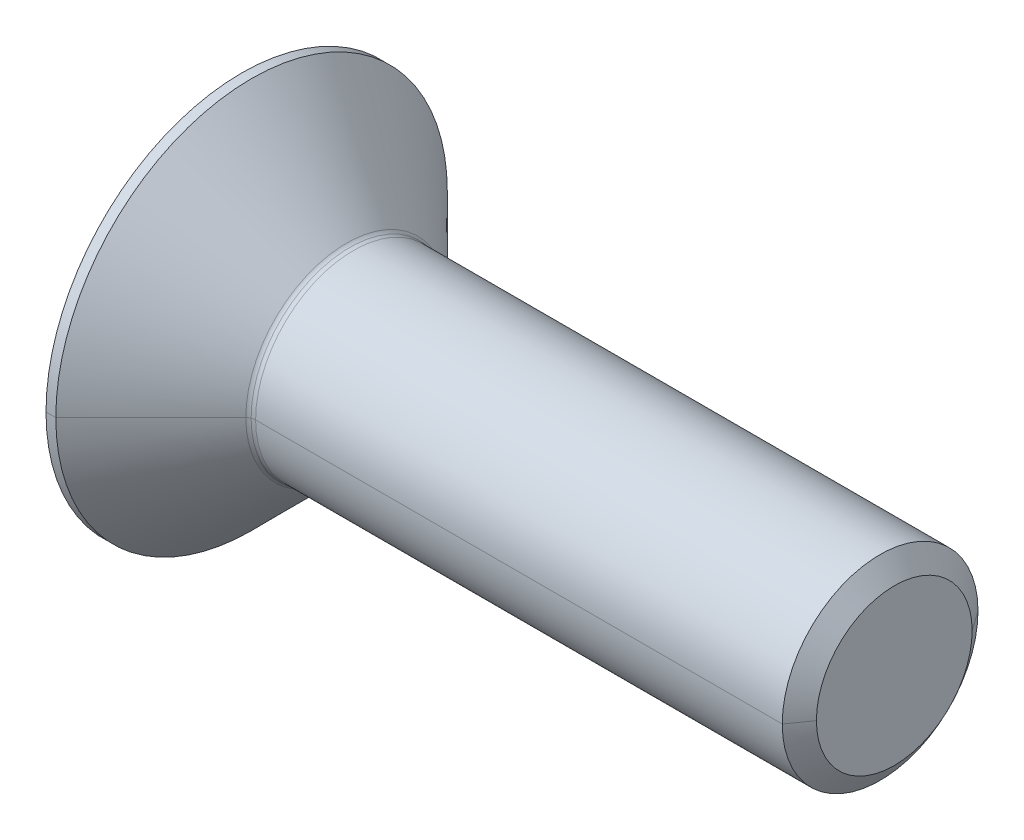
ISO-10303-21;
HEADER;
FILE_DESCRIPTION(('STEP AP214'),'2;1');
FILE_NAME('part.step','',(''),(''),'','','');
FILE_SCHEMA(('AUTOMOTIVE_DESIGN { 1 0 10303 214 1 1 1 1 }'));
ENDSEC;
DATA;
#1=APPLICATION_CONTEXT('core data for automotive mechanical design processes');
#2=APPLICATION_PROTOCOL_DEFINITION('international standard','automotive_design',2000,#1);
#3=PRODUCT_CONTEXT('',#1,'mechanical');
#4=PRODUCT('Part','Part','',(#3));
#5=PRODUCT_RELATED_PRODUCT_CATEGORY('part','',(#4));
#6=PRODUCT_DEFINITION_FORMATION('','',#4);
#7=PRODUCT_DEFINITION_CONTEXT('part definition',#1,'design');
#8=PRODUCT_DEFINITION('design','',#6,#7);
#9=PRODUCT_DEFINITION_SHAPE('','',#8);
#10=(LENGTH_UNIT() NAMED_UNIT(*) SI_UNIT(.MILLI.,.METRE.));
#11=(NAMED_UNIT(*) PLANE_ANGLE_UNIT() SI_UNIT($,.RADIAN.));
#12=(NAMED_UNIT(*) SI_UNIT($,.STERADIAN.) SOLID_ANGLE_UNIT());
#13=UNCERTAINTY_MEASURE_WITH_UNIT(LENGTH_MEASURE(1.E-05),#10,'distance_accuracy_value','');
#14=(GEOMETRIC_REPRESENTATION_CONTEXT(3) GLOBAL_UNCERTAINTY_ASSIGNED_CONTEXT((#13)) GLOBAL_UNIT_ASSIGNED_CONTEXT((#10,
#11,#12)) REPRESENTATION_CONTEXT('',''));
#15=CARTESIAN_POINT('',(0.,0.,0.));
#16=DIRECTION('',(0.,0.,1.));
#17=DIRECTION('',(1.,0.,0.));
#18=AXIS2_PLACEMENT_3D('',#15,#16,#17);
#19=CARTESIAN_POINT('',(0.,-1.151208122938,-2.00201228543));
#20=DIRECTION('',(0.,-0.865151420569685,-0.501510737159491));
#21=DIRECTION('',(0.,0.501510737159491,-0.865151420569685));
#22=AXIS2_PLACEMENT_3D('',#19,#20,#21);
#23=PLANE('',#22);
#24=DIRECTION('',(1.,0.,0.));
#25=VECTOR('',#24,1.);
#26=CARTESIAN_POINT('',(0.1154700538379,-2.30939755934,-0.004030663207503));
#27=LINE('',#26,#25);
#28=CARTESIAN_POINT('',(0.1154700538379,-2.30939755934,-0.004030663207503));
#29=VERTEX_POINT('',#28);
#30=CARTESIAN_POINT('',(2.5,-2.30939755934,-0.004030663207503));
#31=VERTEX_POINT('',#30);
#32=EDGE_CURVE('E404',#29,#31,#27,.T.);
#33=ORIENTED_EDGE('',*,*,#32,.T.);
#34=DIRECTION('',(0.,-0.501510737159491,0.865151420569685));
#35=VECTOR('',#34,1.);
#36=CARTESIAN_POINT('',(2.5,-1.151208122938,-2.00201228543));
#37=LINE('',#36,#35);
#38=CARTESIAN_POINT('',(2.5,-1.151208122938,-2.00201228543));
#39=VERTEX_POINT('',#38);
#40=EDGE_CURVE('E329',#39,#31,#37,.T.);
#41=ORIENTED_EDGE('',*,*,#40,.F.);
#42=DIRECTION('',(-1.,0.,0.));
#43=VECTOR('',#42,1.);
#44=CARTESIAN_POINT('',(2.5,-1.151208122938,-2.00201228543));
#45=LINE('',#44,#43);
#46=CARTESIAN_POINT('',(0.1154700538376,-1.151208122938,-2.00201228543));
#47=VERTEX_POINT('',#46);
#48=EDGE_CURVE('E301',#39,#47,#45,.T.);
#49=ORIENTED_EDGE('',*,*,#48,.T.);
#50=CARTESIAN_POINT('',(0.115470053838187,-2.30939755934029,-0.00403066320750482));
#51=CARTESIAN_POINT('',(0.141208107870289,-2.28357206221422,-0.0485769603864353));
#52=CARTESIAN_POINT('',(0.165950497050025,-2.25746920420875,-0.0935675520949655));
#53=CARTESIAN_POINT('',(0.212019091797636,-2.20576261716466,-0.182684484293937));
#54=CARTESIAN_POINT('',(0.233442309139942,-2.18018063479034,-0.226773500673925));
#55=CARTESIAN_POINT('',(0.27288784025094,-2.12939109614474,-0.314357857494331));
#56=CARTESIAN_POINT('',(0.291001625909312,-2.1042008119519,-0.357821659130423));
#57=CARTESIAN_POINT('',(0.323824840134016,-2.05402986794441,-0.444444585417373));
#58=CARTESIAN_POINT('',(0.338612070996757,-2.02906148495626,-0.487581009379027));
#59=CARTESIAN_POINT('',(0.357871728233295,-1.99235012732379,-0.550925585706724));
#60=CARTESIAN_POINT('',(0.363585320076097,-1.98078711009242,-0.570866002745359));
#61=CARTESIAN_POINT('',(0.374243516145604,-1.95774224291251,-0.610581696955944));
#62=CARTESIAN_POINT('',(0.379198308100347,-1.94626174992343,-0.630355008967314));
#63=CARTESIAN_POINT('',(0.388336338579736,-1.9233713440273,-0.669782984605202));
#64=CARTESIAN_POINT('',(0.392528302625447,-1.91196229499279,-0.689436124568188));
#65=CARTESIAN_POINT('',(0.400143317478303,-1.8891961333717,-0.728667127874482));
#66=CARTESIAN_POINT('',(0.403573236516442,-1.8778395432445,-0.748243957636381));
#67=CARTESIAN_POINT('',(0.409665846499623,-1.85515676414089,-0.7873655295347));
#68=CARTESIAN_POINT('',(0.412333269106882,-1.84383083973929,-0.806909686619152));
#69=CARTESIAN_POINT('',(0.416903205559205,-1.82118353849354,-0.846007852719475));
#70=CARTESIAN_POINT('',(0.41880807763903,-1.80986225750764,-0.865561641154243));
#71=CARTESIAN_POINT('',(0.421855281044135,-1.78719448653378,-0.904719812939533));
#72=CARTESIAN_POINT('',(0.422997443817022,-1.77584799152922,-0.92432420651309));
#73=CARTESIAN_POINT('',(0.424522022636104,-1.75309579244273,-0.96362258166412));
#74=CARTESIAN_POINT('',(0.424901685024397,-1.74169002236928,-0.983316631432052));
#75=CARTESIAN_POINT('',(0.424903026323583,-1.71886724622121,-1.02268531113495));
#76=CARTESIAN_POINT('',(0.424525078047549,-1.70745024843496,-1.04235994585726));
#77=CARTESIAN_POINT('',(0.42300325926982,-1.68466420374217,-1.08161647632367));
#78=CARTESIAN_POINT('',(0.421862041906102,-1.67329512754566,-1.10119845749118));
#79=CARTESIAN_POINT('',(0.418816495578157,-1.65058726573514,-1.14031838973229));
#80=CARTESIAN_POINT('',(0.416912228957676,-1.63924847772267,-1.15985634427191));
#81=CARTESIAN_POINT('',(0.412343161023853,-1.61658011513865,-1.19893463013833));
#82=CARTESIAN_POINT('',(0.409675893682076,-1.60525069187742,-1.21847476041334));
#83=CARTESIAN_POINT('',(0.403583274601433,-1.58257672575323,-1.25760119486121));
#84=CARTESIAN_POINT('',(0.400153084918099,-1.57123256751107,-1.27718696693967));
#85=CARTESIAN_POINT('',(0.392537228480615,-1.54850150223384,-1.31644559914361));
#86=CARTESIAN_POINT('',(0.388344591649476,-1.53711523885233,-1.33611747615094));
#87=CARTESIAN_POINT('',(0.379204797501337,-1.51427089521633,-1.37558704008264));
#88=CARTESIAN_POINT('',(0.374248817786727,-1.50281371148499,-1.39538319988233));
#89=CARTESIAN_POINT('',(0.363588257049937,-1.47979138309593,-1.43513463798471));
#90=CARTESIAN_POINT('',(0.357873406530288,-1.46822725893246,-1.45508773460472));
#91=CARTESIAN_POINT('',(0.338617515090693,-1.43149889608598,-1.51842455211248));
#92=CARTESIAN_POINT('',(0.323835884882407,-1.40647769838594,-1.56151942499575));
#93=CARTESIAN_POINT('',(0.291020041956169,-1.35624773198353,-1.64809304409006));
#94=CARTESIAN_POINT('',(0.272907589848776,-1.33105271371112,-1.69154977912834));
#95=CARTESIAN_POINT('',(0.233461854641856,-1.28029324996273,-1.77915081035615));
#96=CARTESIAN_POINT('',(0.212036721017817,-1.25474769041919,-1.82326432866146));
#97=CARTESIAN_POINT('',(0.16596107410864,-1.2031074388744,-1.9124349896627));
#98=CARTESIAN_POINT('',(0.141213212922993,-1.17703438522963,-1.95745457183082));
#99=CARTESIAN_POINT('',(0.115470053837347,-1.15120812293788,-2.00201228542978));
#100=B_SPLINE_CURVE_WITH_KNOTS('',3,(#50,#51,#52,#53,#54,#55,#56,#57,#58,#59,#60,#61,#62,#63,
#64,#65,#66,#67,#68,#69,#70,#71,#72,#73,#74,#75,#76,#77,#78,#79,#80,#81,#82,#83,#84,#85,#86,#87,
#88,#89,#90,#91,#92,#93,#94,#95,#96,#97,#98,#99),.UNSPECIFIED.,.F.,.F.,(4,2,2,2,2,2,2,2,2,2,2,2,
2,2,2,2,2,2,2,2,2,2,2,2,4),(0.,0.172719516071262,0.338535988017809,0.498662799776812,
0.65452610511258,0.725761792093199,0.795936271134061,0.865249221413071,0.933909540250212,
1.00213404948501,1.07014590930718,1.13817279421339,1.20644490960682,1.27468343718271,
1.34268599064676,1.41068298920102,1.47890228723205,1.54756718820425,1.61689462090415,
1.68709355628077,1.75836371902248,1.91419494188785,2.07430973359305,2.24013655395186,
2.41289052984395),.UNSPECIFIED.);
#101=EDGE_CURVE('E11',#29,#47,#100,.T.);
#102=ORIENTED_EDGE('',*,*,#101,.F.);
#103=EDGE_LOOP('',(#33,#41,#49,#102));
#104=FACE_BOUND('',#103,.T.);
#105=ADVANCED_FACE('F16',(#104),#23,.F.);
#106=CARTESIAN_POINT('',(0.2133748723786,0.,8.071961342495E-13));
#107=DIRECTION('',(-1.,0.,3.64996555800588E-13));
#108=DIRECTION('',(3.64996555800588E-13,0.,1.));
#109=AXIS2_PLACEMENT_3D('',#106,#107,#108);
#110=CONICAL_SURFACE('',#109,2.211496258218,0.785398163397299);
#111=CARTESIAN_POINT('',(0.115470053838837,-1.15818943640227,1.99798162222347));
#112=CARTESIAN_POINT('',(0.141208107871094,-1.18385491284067,1.95334293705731));
#113=CARTESIAN_POINT('',(0.165950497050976,-1.20976647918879,1.90824190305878));
#114=CARTESIAN_POINT('',(0.212019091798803,-1.26109071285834,1.81890421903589));
#115=CARTESIAN_POINT('',(0.233442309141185,-1.2864819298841,1.7747050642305));
#116=CARTESIAN_POINT('',(0.272887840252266,-1.33693743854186,1.68692785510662));
#117=CARTESIAN_POINT('',(0.29100162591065,-1.36198305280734,1.64338052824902));
#118=CARTESIAN_POINT('',(0.323824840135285,-1.41191523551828,1.55661975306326));
#119=CARTESIAN_POINT('',(0.33861207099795,-1.43678828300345,1.51342828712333));
#120=CARTESIAN_POINT('',(0.357871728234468,-1.47329061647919,1.44996303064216));
#121=CARTESIAN_POINT('',(0.363585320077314,-1.4847780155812,1.42997895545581));
#122=CARTESIAN_POINT('',(0.374243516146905,-1.50765038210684,1.39016366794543));
#123=CARTESIAN_POINT('',(0.379198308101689,-1.5190343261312,1.37033461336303));
#124=CARTESIAN_POINT('',(0.388336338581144,-1.54173475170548,1.33079695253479));
#125=CARTESIAN_POINT('',(0.392528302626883,-1.55305034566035,1.31108985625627));
#126=CARTESIAN_POINT('',(0.400143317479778,-1.57564231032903,1.27175828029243));
#127=CARTESIAN_POINT('',(0.403573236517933,-1.58691804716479,1.25213476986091));
#128=CARTESIAN_POINT('',(0.409665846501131,-1.60945693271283,1.21293012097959));
#129=CARTESIAN_POINT('',(0.412333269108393,-1.62071970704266,1.19334950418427));
#130=CARTESIAN_POINT('',(0.416903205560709,-1.6432560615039,1.15418728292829));
#131=CARTESIAN_POINT('',(0.418808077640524,-1.65452949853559,1.13460587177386));
#132=CARTESIAN_POINT('',(0.421855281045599,-1.67710758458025,1.09539592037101));
#133=CARTESIAN_POINT('',(0.422997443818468,-1.68841223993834,1.07576737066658));
#134=CARTESIAN_POINT('',(0.424522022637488,-1.71106953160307,1.03641420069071));
#135=CARTESIAN_POINT('',(0.42490168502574,-1.72242219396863,1.01668948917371));
#136=CARTESIAN_POINT('',(0.42490302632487,-1.74510508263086,0.977240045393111));
#137=CARTESIAN_POINT('',(0.424525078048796,-1.75643531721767,0.957515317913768));
#138=CARTESIAN_POINT('',(0.423003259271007,-1.77903944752,0.918153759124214));
#139=CARTESIAN_POINT('',(0.421862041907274,-1.79031340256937,0.898516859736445));
#140=CARTESIAN_POINT('',(0.418816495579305,-1.81283832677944,0.859291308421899));
#141=CARTESIAN_POINT('',(0.416912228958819,-1.82408929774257,0.839702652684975));
#142=CARTESIAN_POINT('',(0.412343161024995,-1.84659790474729,0.800532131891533));
#143=CARTESIAN_POINT('',(0.409675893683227,-1.8578554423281,0.780950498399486));
#144=CARTESIAN_POINT('',(0.403583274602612,-1.88040294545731,0.741751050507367));
#145=CARTESIAN_POINT('',(0.4001530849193,-1.89169264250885,0.722133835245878));
#146=CARTESIAN_POINT('',(0.39253722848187,-1.91432608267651,0.682818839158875));
#147=CARTESIAN_POINT('',(0.388344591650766,-1.92566929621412,0.663122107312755));
#148=CARTESIAN_POINT('',(0.379204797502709,-1.94842876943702,0.623603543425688));
#149=CARTESIAN_POINT('',(0.374248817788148,-1.95984415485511,0.603783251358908));
#150=CARTESIAN_POINT('',(0.363588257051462,-1.9827587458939,0.563969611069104));
#151=CARTESIAN_POINT('',(0.357873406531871,-1.99425657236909,0.543978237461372));
#152=CARTESIAN_POINT('',(0.338617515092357,-2.03074368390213,0.480502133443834));
#153=CARTESIAN_POINT('',(0.323835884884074,-2.05555433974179,0.437285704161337));
#154=CARTESIAN_POINT('',(0.291020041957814,-2.10541430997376,0.350498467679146));
#155=CARTESIAN_POINT('',(0.272907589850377,-2.13045143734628,0.306950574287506));
#156=CARTESIAN_POINT('',(0.233461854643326,-2.18093642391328,0.219191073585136));
#157=CARTESIAN_POINT('',(0.212036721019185,-2.20636707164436,0.175011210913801));
#158=CARTESIAN_POINT('',(0.165961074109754,-2.25777100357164,0.0857041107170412));
#159=CARTESIAN_POINT('',(0.141213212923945,-2.2837225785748,0.0406143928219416));
#160=CARTESIAN_POINT('',(0.115470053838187,-2.30939755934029,-0.00403066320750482));
#161=B_SPLINE_CURVE_WITH_KNOTS('',3,(#111,#112,#113,#114,#115,#116,#117,#118,#119,#120,#121,
#122,#123,#124,#125,#126,#127,#128,#129,#130,#131,#132,#133,#134,#135,#136,#137,#138,#139,#140,
#141,#142,#143,#144,#145,#146,#147,#148,#149,#150,#151,#152,#153,#154,#155,#156,#157,#158,#159,
#160),.UNSPECIFIED.,.F.,.F.,(4,2,2,2,2,2,2,2,2,2,2,2,2,2,2,2,2,2,2,2,2,2,2,2,4),(0.,
0.172719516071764,0.338535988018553,0.498662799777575,0.654526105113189,0.725761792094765,
0.795936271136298,0.865249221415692,0.933909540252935,1.00213404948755,1.07014590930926,
1.13817279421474,1.20644490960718,1.27468343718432,1.3426859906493,1.41068298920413,
1.4789022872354,1.54756718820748,1.61689462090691,1.68709355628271,1.75836371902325,
1.91419494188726,2.07430973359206,2.24013655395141,2.41289052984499),.UNSPECIFIED.);
#162=CARTESIAN_POINT('',(0.1154700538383,-1.158189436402,1.997981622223));
#163=VERTEX_POINT('',#162);
#164=EDGE_CURVE('E379',#163,#29,#161,.T.);
#165=ORIENTED_EDGE('',*,*,#164,.T.);
#166=ORIENTED_EDGE('',*,*,#101,.T.);
#167=CARTESIAN_POINT('',(0.1154700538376,-1.151208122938,-2.00201228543));
#168=CARTESIAN_POINT('',(0.1461942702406,-1.089759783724,-2.001905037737));
#169=CARTESIAN_POINT('',(0.2026006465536,-0.9695372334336,-2.001695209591));
#170=CARTESIAN_POINT('',(0.2719089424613,-0.7985716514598,-2.001396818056));
#171=CARTESIAN_POINT('',(0.3277607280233,-0.6335959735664,-2.001108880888));
#172=CARTESIAN_POINT('',(0.3709207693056,-0.4727049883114,-2.000828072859));
#173=CARTESIAN_POINT('',(0.401850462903,-0.3138718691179,-2.000550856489));
#174=CARTESIAN_POINT('',(0.4204962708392,-0.1567494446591,-2.000276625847));
#175=CARTESIAN_POINT('',(0.4247770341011,-0.05216793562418,-2.000094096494));
#176=CARTESIAN_POINT('',(0.4248680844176,0.,-2.000003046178));
#177=(BOUNDED_CURVE() B_SPLINE_CURVE(3,(#167,#168,#169,#170,#171,#172,#173,#174,#175,#176),
.UNSPECIFIED.,.F.,.F.) B_SPLINE_CURVE_WITH_KNOTS((4,1,1,1,1,1,1,4),(0.,0.1428571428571,
0.2857142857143,0.4285714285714,0.5714285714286,0.7142857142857,0.8571428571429,1.),
.UNSPECIFIED.) CURVE() GEOMETRIC_REPRESENTATION_ITEM() RATIONAL_B_SPLINE_CURVE((1.,1.,1.,1.,1.,
1.,1.,1.,1.,1.)) REPRESENTATION_ITEM(''));
#178=CARTESIAN_POINT('',(0.4248680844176,0.,-2.000003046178));
#179=VERTEX_POINT('',#178);
#180=EDGE_CURVE('E221',#47,#179,#177,.T.);
#181=ORIENTED_EDGE('',*,*,#180,.T.);
#182=DIRECTION('',(-0.707106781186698,0.,-0.707106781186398));
#183=VECTOR('',#182,1.);
#184=CARTESIAN_POINT('',(0.4248680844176,0.,-2.000003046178));
#185=LINE('',#184,#183);
#186=CARTESIAN_POINT('',(-5.90028026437E-13,0.,-2.424871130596));
#187=VERTEX_POINT('',#186);
#188=EDGE_CURVE('E291',#179,#187,#185,.T.);
#189=ORIENTED_EDGE('',*,*,#188,.T.);
#190=CARTESIAN_POINT('',(0.,0.,8.850779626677E-13));
#191=DIRECTION('',(1.,0.,-3.65E-13));
#192=DIRECTION('',(3.65E-13,0.,1.));
#193=AXIS2_PLACEMENT_3D('',#190,#191,#192);
#194=CIRCLE('',#193,2.424871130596);
#195=CARTESIAN_POINT('',(5.903610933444E-13,0.,2.424871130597));
#196=VERTEX_POINT('',#195);
#197=EDGE_CURVE('E222',#196,#187,#194,.T.);
#198=ORIENTED_EDGE('',*,*,#197,.F.);
#199=DIRECTION('',(-0.707106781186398,0.,0.707106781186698));
#200=VECTOR('',#199,1.);
#201=CARTESIAN_POINT('',(0.424868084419,0.,2.000003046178));
#202=LINE('',#201,#200);
#203=CARTESIAN_POINT('',(0.424868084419,0.,2.000003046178));
#204=VERTEX_POINT('',#203);
#205=EDGE_CURVE('E295',#204,#196,#202,.T.);
#206=ORIENTED_EDGE('',*,*,#205,.F.);
#207=CARTESIAN_POINT('',(0.424868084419,0.,2.000003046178));
#208=CARTESIAN_POINT('',(0.4249597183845,-0.05250234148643,1.999911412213));
#209=CARTESIAN_POINT('',(0.4209923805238,-0.157745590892,1.999727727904));
#210=CARTESIAN_POINT('',(0.4026574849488,-0.3158357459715,1.999451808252));
#211=CARTESIAN_POINT('',(0.3718845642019,-0.4756221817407,1.999172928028));
#212=CARTESIAN_POINT('',(0.3287264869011,-0.6374714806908,1.998890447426));
#213=CARTESIAN_POINT('',(0.2727299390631,-0.803409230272,1.998600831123));
#214=CARTESIAN_POINT('',(0.2031200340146,-0.9753855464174,1.998300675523));
#215=CARTESIAN_POINT('',(0.1463878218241,-1.096353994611,1.998089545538));
#216=CARTESIAN_POINT('',(0.1154700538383,-1.158189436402,1.997981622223));
#217=(BOUNDED_CURVE() B_SPLINE_CURVE(3,(#207,#208,#209,#210,#211,#212,#213,#214,#215,#216),
.UNSPECIFIED.,.F.,.F.) B_SPLINE_CURVE_WITH_KNOTS((4,1,1,1,1,1,1,4),(0.,0.1428571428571,
0.2857142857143,0.4285714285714,0.5714285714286,0.7142857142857,0.8571428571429,1.),
.UNSPECIFIED.) CURVE() GEOMETRIC_REPRESENTATION_ITEM() RATIONAL_B_SPLINE_CURVE((1.,1.,1.,1.,1.,
1.,1.,1.,1.,1.)) REPRESENTATION_ITEM(''));
#218=EDGE_CURVE('E26',#204,#163,#217,.T.);
#219=ORIENTED_EDGE('',*,*,#218,.T.);
#220=EDGE_LOOP('',(#165,#166,#181,#189,#198,#206,#219));
#221=FACE_BOUND('',#220,.T.);
#222=ADVANCED_FACE('F348',(#221),#110,.F.);
#223=CARTESIAN_POINT('',(0.,-1.158189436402,1.997981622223));
#224=DIRECTION('',(0.,-0.00174532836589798,0.999998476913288));
#225=DIRECTION('',(-1.,0.,0.));
#226=AXIS2_PLACEMENT_3D('',#223,#224,#225);
#227=PLANE('',#226);
#228=CARTESIAN_POINT('',(0.1154700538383,1.151208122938,2.00201228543));
#229=CARTESIAN_POINT('',(0.1461942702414,1.089759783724,2.001905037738));
#230=CARTESIAN_POINT('',(0.2026006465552,0.9695372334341,2.001695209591));
#231=CARTESIAN_POINT('',(0.2719089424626,0.7985716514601,2.001396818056));
#232=CARTESIAN_POINT('',(0.3277607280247,0.6335959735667,2.001108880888));
#233=CARTESIAN_POINT('',(0.370920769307,0.4727049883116,2.000828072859));
#234=CARTESIAN_POINT('',(0.4018504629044,0.3138718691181,2.000550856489));
#235=CARTESIAN_POINT('',(0.4204962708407,0.1567494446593,2.000276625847));
#236=CARTESIAN_POINT('',(0.4247770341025,0.05216793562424,2.000094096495));
#237=CARTESIAN_POINT('',(0.424868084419,0.,2.000003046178));
#238=(BOUNDED_CURVE() B_SPLINE_CURVE(3,(#228,#229,#230,#231,#232,#233,#234,#235,#236,#237),
.UNSPECIFIED.,.F.,.F.) B_SPLINE_CURVE_WITH_KNOTS((4,1,1,1,1,1,1,4),(0.,0.1428571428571,
0.2857142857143,0.4285714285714,0.5714285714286,0.7142857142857,0.8571428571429,1.),
.UNSPECIFIED.) CURVE() GEOMETRIC_REPRESENTATION_ITEM() RATIONAL_B_SPLINE_CURVE((1.,1.,1.,1.,1.,
1.,1.,1.,1.,1.)) REPRESENTATION_ITEM(''));
#239=CARTESIAN_POINT('',(0.1154700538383,1.151208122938,2.00201228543));
#240=VERTEX_POINT('',#239);
#241=EDGE_CURVE('E309',#240,#204,#238,.T.);
#242=ORIENTED_EDGE('',*,*,#241,.F.);
#243=DIRECTION('',(-1.,0.,0.));
#244=VECTOR('',#243,1.);
#245=CARTESIAN_POINT('',(2.5,1.151208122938,2.00201228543));
#246=LINE('',#245,#244);
#247=CARTESIAN_POINT('',(2.5,1.151208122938,2.00201228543));
#248=VERTEX_POINT('',#247);
#249=EDGE_CURVE('E319',#248,#240,#246,.T.);
#250=ORIENTED_EDGE('',*,*,#249,.F.);
#251=DIRECTION('',(0.,-0.999998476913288,-0.00174532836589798));
#252=VECTOR('',#251,1.);
#253=CARTESIAN_POINT('',(2.5,1.151208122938,2.00201228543));
#254=LINE('',#253,#252);
#255=CARTESIAN_POINT('',(2.5,-1.158189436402,1.997981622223));
#256=VERTEX_POINT('',#255);
#257=EDGE_CURVE('E337',#248,#256,#254,.T.);
#258=ORIENTED_EDGE('',*,*,#257,.T.);
#259=DIRECTION('',(1.,0.,0.));
#260=VECTOR('',#259,1.);
#261=CARTESIAN_POINT('',(0.1154700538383,-1.158189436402,1.997981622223));
#262=LINE('',#261,#260);
#263=EDGE_CURVE('E341',#163,#256,#262,.T.);
#264=ORIENTED_EDGE('',*,*,#263,.F.);
#265=ORIENTED_EDGE('',*,*,#218,.F.);
#266=EDGE_LOOP('',(#242,#250,#258,#264,#265));
#267=FACE_BOUND('',#266,.T.);
#268=ADVANCED_FACE('F358',(#267),#227,.F.);
#269=CARTESIAN_POINT('',(0.,-2.30939755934,-0.004030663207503));
#270=DIRECTION('',(0.,-0.866896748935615,0.498487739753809));
#271=DIRECTION('',(-1.,0.,0.));
#272=AXIS2_PLACEMENT_3D('',#269,#270,#271);
#273=PLANE('',#272);
#274=ORIENTED_EDGE('',*,*,#263,.T.);
#275=DIRECTION('',(0.,0.498487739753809,0.866896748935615));
#276=VECTOR('',#275,1.);
#277=CARTESIAN_POINT('',(2.5,-2.30939755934,-0.004030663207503));
#278=LINE('',#277,#276);
#279=EDGE_CURVE('E333',#31,#256,#278,.T.);
#280=ORIENTED_EDGE('',*,*,#279,.F.);
#281=ORIENTED_EDGE('',*,*,#32,.F.);
#282=ORIENTED_EDGE('',*,*,#164,.F.);
#283=EDGE_LOOP('',(#274,#280,#281,#282));
#284=FACE_BOUND('',#283,.T.);
#285=ADVANCED_FACE('F386',(#284),#273,.F.);
#286=CARTESIAN_POINT('',(2.5,0.,0.));
#287=DIRECTION('',(1.,0.,0.));
#288=DIRECTION('',(0.,1.,0.));
#289=AXIS2_PLACEMENT_3D('',#286,#287,#288);
#290=PLANE('',#289);
#291=CARTESIAN_POINT('',(2.5,0.,4.172510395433E-13));
#292=DIRECTION('',(1.,0.,-3.64905216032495E-13));
#293=DIRECTION('',(3.64905216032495E-13,0.,1.));
#294=AXIS2_PLACEMENT_3D('',#291,#292,#293);
#295=CIRCLE('',#294,1.98);
#296=CARTESIAN_POINT('',(2.500000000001,0.,1.98));
#297=VERTEX_POINT('',#296);
#298=CARTESIAN_POINT('',(2.499999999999,0.,-1.98));
#299=VERTEX_POINT('',#298);
#300=EDGE_CURVE('E310',#297,#299,#295,.T.);
#301=ORIENTED_EDGE('',*,*,#300,.T.);
#302=CARTESIAN_POINT('',(2.5,0.,4.172510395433E-13));
#303=DIRECTION('',(1.,0.,-3.64905216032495E-13));
#304=DIRECTION('',(-3.64905216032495E-13,0.,-1.));
#305=AXIS2_PLACEMENT_3D('',#302,#303,#304);
#306=CIRCLE('',#305,1.98);
#307=EDGE_CURVE('E314',#299,#297,#306,.T.);
#308=ORIENTED_EDGE('',*,*,#307,.T.);
#309=EDGE_LOOP('',(#301,#308));
#310=FACE_BOUND('',#309,.T.);
#311=DIRECTION('',(0.,-0.498487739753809,-0.866896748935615));
#312=VECTOR('',#311,1.);
#313=CARTESIAN_POINT('',(2.5,2.30939755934,0.004030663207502));
#314=LINE('',#313,#312);
#315=CARTESIAN_POINT('',(2.5,2.30939755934,0.004030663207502));
#316=VERTEX_POINT('',#315);
#317=CARTESIAN_POINT('',(2.5,1.158189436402,-1.997981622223));
#318=VERTEX_POINT('',#317);
#319=EDGE_CURVE('E302',#316,#318,#314,.T.);
#320=ORIENTED_EDGE('',*,*,#319,.T.);
#321=DIRECTION('',(0.,0.999998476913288,0.00174532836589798));
#322=VECTOR('',#321,1.);
#323=CARTESIAN_POINT('',(2.5,-1.151208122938,-2.00201228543));
#324=LINE('',#323,#322);
#325=EDGE_CURVE('E296',#39,#318,#324,.T.);
#326=ORIENTED_EDGE('',*,*,#325,.F.);
#327=ORIENTED_EDGE('',*,*,#40,.T.);
#328=ORIENTED_EDGE('',*,*,#279,.T.);
#329=ORIENTED_EDGE('',*,*,#257,.F.);
#330=DIRECTION('',(0.,0.501510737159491,-0.865151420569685));
#331=VECTOR('',#330,1.);
#332=CARTESIAN_POINT('',(2.5,1.151208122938,2.00201228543));
#333=LINE('',#332,#331);
#334=EDGE_CURVE('E316',#248,#316,#333,.T.);
#335=ORIENTED_EDGE('',*,*,#334,.T.);
#336=EDGE_LOOP('',(#320,#326,#327,#328,#329,#335));
#337=FACE_BOUND('',#336,.T.);
#338=ADVANCED_FACE('F394',(#310,#337),#290,.F.);
#339=CARTESIAN_POINT('',(3.060145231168,0.,2.127980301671E-13));
#340=DIRECTION('',(-1.,0.,3.65051236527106E-13));
#341=DIRECTION('',(3.65051236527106E-13,0.,1.));
#342=AXIS2_PLACEMENT_3D('',#339,#340,#341);
#343=CONICAL_SURFACE('',#342,1.0098,1.0471975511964);
#344=DIRECTION('',(-0.50000000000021,0.,-0.866025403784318));
#345=VECTOR('',#344,1.);
#346=CARTESIAN_POINT('',(3.643153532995,0.,0.));
#347=LINE('',#346,#345);
#348=CARTESIAN_POINT('',(3.643153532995,0.,0.));
#349=VERTEX_POINT('',#348);
#350=EDGE_CURVE('E315',#349,#299,#347,.T.);
#351=ORIENTED_EDGE('',*,*,#350,.F.);
#352=DIRECTION('',(-0.49999999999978,0.,0.866025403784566));
#353=VECTOR('',#352,1.);
#354=CARTESIAN_POINT('',(3.643153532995,0.,0.));
#355=LINE('',#354,#353);
#356=EDGE_CURVE('E320',#349,#297,#355,.T.);
#357=ORIENTED_EDGE('',*,*,#356,.T.);
#358=ORIENTED_EDGE('',*,*,#307,.F.);
#359=EDGE_LOOP('',(#351,#357,#358));
#360=FACE_BOUND('',#359,.T.);
#361=ADVANCED_FACE('F701',(#360),#343,.F.);
#362=CARTESIAN_POINT('',(3.060145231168,0.,2.127980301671E-13));
#363=DIRECTION('',(-1.,0.,3.65051236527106E-13));
#364=DIRECTION('',(3.65051236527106E-13,0.,1.));
#365=AXIS2_PLACEMENT_3D('',#362,#363,#364);
#366=CONICAL_SURFACE('',#365,1.0098,1.0471975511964);
#367=ORIENTED_EDGE('',*,*,#356,.F.);
#368=ORIENTED_EDGE('',*,*,#350,.T.);
#369=ORIENTED_EDGE('',*,*,#300,.F.);
#370=EDGE_LOOP('',(#367,#368,#369));
#371=FACE_BOUND('',#370,.T.);
#372=ADVANCED_FACE('F362',(#371),#366,.F.);
#373=CARTESIAN_POINT('',(0.,1.151208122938,2.00201228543));
#374=DIRECTION('',(0.,0.865151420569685,0.501510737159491));
#375=DIRECTION('',(1.,0.,0.));
#376=AXIS2_PLACEMENT_3D('',#373,#374,#375);
#377=PLANE('',#376);
#378=DIRECTION('',(-1.,0.,0.));
#379=VECTOR('',#378,1.);
#380=CARTESIAN_POINT('',(2.5,2.30939755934,0.004030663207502));
#381=LINE('',#380,#379);
#382=CARTESIAN_POINT('',(0.1154700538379,2.30939755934,0.004030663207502));
#383=VERTEX_POINT('',#382);
#384=EDGE_CURVE('E305',#316,#383,#381,.T.);
#385=ORIENTED_EDGE('',*,*,#384,.F.);
#386=ORIENTED_EDGE('',*,*,#334,.F.);
#387=ORIENTED_EDGE('',*,*,#249,.T.);
#388=CARTESIAN_POINT('',(0.11547005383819,2.30939755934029,0.00403066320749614));
#389=CARTESIAN_POINT('',(0.141208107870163,2.28357206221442,0.0485769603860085));
#390=CARTESIAN_POINT('',(0.16595049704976,2.25746920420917,0.093567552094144));
#391=CARTESIAN_POINT('',(0.212019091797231,2.20576261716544,0.18268448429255));
#392=CARTESIAN_POINT('',(0.233442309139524,2.18018063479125,0.226773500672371));
#393=CARTESIAN_POINT('',(0.272887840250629,2.12939109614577,0.314357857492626));
#394=CARTESIAN_POINT('',(0.291001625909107,2.10420081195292,0.35782165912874));
#395=CARTESIAN_POINT('',(0.323824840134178,2.05402986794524,0.444444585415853));
#396=CARTESIAN_POINT('',(0.338612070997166,2.0290614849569,0.487581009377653));
#397=CARTESIAN_POINT('',(0.357871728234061,1.99235012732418,0.550925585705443));
#398=CARTESIAN_POINT('',(0.363585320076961,1.98078711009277,0.570866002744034));
#399=CARTESIAN_POINT('',(0.37424351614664,1.9577422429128,0.610581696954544));
#400=CARTESIAN_POINT('',(0.379198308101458,1.94626174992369,0.630355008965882));
#401=CARTESIAN_POINT('',(0.388336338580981,1.92337134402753,0.669782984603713));
#402=CARTESIAN_POINT('',(0.392528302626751,1.91196229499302,0.689436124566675));
#403=CARTESIAN_POINT('',(0.400143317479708,1.88919613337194,0.728667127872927));
#404=CARTESIAN_POINT('',(0.403573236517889,1.87783954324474,0.74824395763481));
#405=CARTESIAN_POINT('',(0.409665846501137,1.85515676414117,0.787365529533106));
#406=CARTESIAN_POINT('',(0.412333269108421,1.84383083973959,0.806909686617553));
#407=CARTESIAN_POINT('',(0.416903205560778,1.82118353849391,0.846007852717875));
#408=CARTESIAN_POINT('',(0.41880807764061,1.80986225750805,0.865561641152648));
#409=CARTESIAN_POINT('',(0.421855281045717,1.78719448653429,0.904719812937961));
#410=CARTESIAN_POINT('',(0.422997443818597,1.77584799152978,0.924324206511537));
#411=CARTESIAN_POINT('',(0.424522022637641,1.75309579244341,0.963622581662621));
#412=CARTESIAN_POINT('',(0.424901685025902,1.74169002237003,0.983316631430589));
#413=CARTESIAN_POINT('',(0.424903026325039,1.71886724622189,1.0226853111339));
#414=CARTESIAN_POINT('',(0.424525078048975,1.70745024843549,1.04235994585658));
#415=CARTESIAN_POINT('',(0.423003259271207,1.68466420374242,1.08161647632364));
#416=CARTESIAN_POINT('',(0.421862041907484,1.67329512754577,1.10119845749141));
#417=CARTESIAN_POINT('',(0.418816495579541,1.65058726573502,1.14031838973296));
#418=CARTESIAN_POINT('',(0.41691222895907,1.63924847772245,1.15985634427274));
#419=CARTESIAN_POINT('',(0.412343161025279,1.61658011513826,1.19893463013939));
#420=CARTESIAN_POINT('',(0.409675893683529,1.60525069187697,1.21847476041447));
#421=CARTESIAN_POINT('',(0.403583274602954,1.5825767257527,1.25760119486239));
#422=CARTESIAN_POINT('',(0.400153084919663,1.57123256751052,1.27718696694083));
#423=CARTESIAN_POINT('',(0.39253722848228,1.54850150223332,1.31644559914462));
#424=CARTESIAN_POINT('',(0.388344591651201,1.53711523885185,1.33611747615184));
#425=CARTESIAN_POINT('',(0.379204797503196,1.514270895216,1.37558704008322));
#426=CARTESIAN_POINT('',(0.374248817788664,1.50281371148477,1.39538319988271));
#427=CARTESIAN_POINT('',(0.36358825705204,1.47979138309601,1.4351346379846));
#428=CARTESIAN_POINT('',(0.357873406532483,1.46822725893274,1.45508773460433));
#429=CARTESIAN_POINT('',(0.338617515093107,1.43149889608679,1.51842455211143));
#430=CARTESIAN_POINT('',(0.323835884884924,1.40647769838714,1.56151942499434));
#431=CARTESIAN_POINT('',(0.291020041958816,1.3562477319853,1.64809304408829));
#432=CARTESIAN_POINT('',(0.272907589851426,1.33105271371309,1.69154977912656));
#433=CARTESIAN_POINT('',(0.233461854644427,1.28029324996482,1.77915081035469));
#434=CARTESIAN_POINT('',(0.212036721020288,1.25474769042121,1.82326432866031));
#435=CARTESIAN_POINT('',(0.165961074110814,1.20310743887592,1.91243498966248));
#436=CARTESIAN_POINT('',(0.141213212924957,1.17703438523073,1.95745457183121));
#437=CARTESIAN_POINT('',(0.115470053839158,1.15120812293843,2.00201228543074));
#438=B_SPLINE_CURVE_WITH_KNOTS('',3,(#388,#389,#390,#391,#392,#393,#394,#395,#396,#397,#398,
#399,#400,#401,#402,#403,#404,#405,#406,#407,#408,#409,#410,#411,#412,#413,#414,#415,#416,#417,
#418,#419,#420,#421,#422,#423,#424,#425,#426,#427,#428,#429,#430,#431,#432,#433,#434,#435,#436,
#437),.UNSPECIFIED.,.F.,.F.,(4,2,2,2,2,2,2,2,2,2,2,2,2,2,2,2,2,2,2,2,2,2,2,2,4),(0.,
0.17271951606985,0.338535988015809,0.498662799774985,0.6545261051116,0.725761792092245,
0.795936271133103,0.86524922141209,0.933909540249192,1.00213404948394,1.07014590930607,
1.13817279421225,1.20644490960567,1.27468343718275,1.3426859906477,1.41068298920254,
1.47890228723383,1.54756718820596,1.61689462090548,1.68709355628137,1.75836371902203,
1.91419494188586,2.07430973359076,2.24013655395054,2.41289052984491),.UNSPECIFIED.);
#439=EDGE_CURVE('E294',#383,#240,#438,.T.);
#440=ORIENTED_EDGE('',*,*,#439,.F.);
#441=EDGE_LOOP('',(#385,#386,#387,#440));
#442=FACE_BOUND('',#441,.T.);
#443=ADVANCED_FACE('F359',(#442),#377,.F.);
#444=CARTESIAN_POINT('',(0.2133748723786,0.,8.071961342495E-13));
#445=DIRECTION('',(-1.,0.,3.64996555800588E-13));
#446=DIRECTION('',(3.64996555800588E-13,0.,1.));
#447=AXIS2_PLACEMENT_3D('',#444,#445,#446);
#448=CONICAL_SURFACE('',#447,2.211496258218,0.785398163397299);
#449=ORIENTED_EDGE('',*,*,#241,.T.);
#450=ORIENTED_EDGE('',*,*,#205,.T.);
#451=CARTESIAN_POINT('',(0.,0.,8.850779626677E-13));
#452=DIRECTION('',(1.,0.,-3.65E-13));
#453=DIRECTION('',(-3.65E-13,0.,-1.));
#454=AXIS2_PLACEMENT_3D('',#451,#452,#453);
#455=CIRCLE('',#454,2.424871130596);
#456=EDGE_CURVE('E218',#187,#196,#455,.T.);
#457=ORIENTED_EDGE('',*,*,#456,.F.);
#458=ORIENTED_EDGE('',*,*,#188,.F.);
#459=CARTESIAN_POINT('',(0.4248680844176,0.,-2.000003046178));
#460=CARTESIAN_POINT('',(0.424959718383,0.05250234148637,-1.999911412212));
#461=CARTESIAN_POINT('',(0.4209923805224,0.1577455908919,-1.999727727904));
#462=CARTESIAN_POINT('',(0.4026574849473,0.3158357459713,-1.999451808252));
#463=CARTESIAN_POINT('',(0.3718845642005,0.4756221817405,-1.999172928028));
#464=CARTESIAN_POINT('',(0.3287264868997,0.6374714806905,-1.998890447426));
#465=CARTESIAN_POINT('',(0.2727299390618,0.8034092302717,-1.998600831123));
#466=CARTESIAN_POINT('',(0.203120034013,0.975385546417,-1.998300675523));
#467=CARTESIAN_POINT('',(0.1463878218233,1.096353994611,-1.998089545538));
#468=CARTESIAN_POINT('',(0.1154700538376,1.158189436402,-1.997981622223));
#469=(BOUNDED_CURVE() B_SPLINE_CURVE(3,(#459,#460,#461,#462,#463,#464,#465,#466,#467,#468),
.UNSPECIFIED.,.F.,.F.) B_SPLINE_CURVE_WITH_KNOTS((4,1,1,1,1,1,1,4),(0.,0.1428571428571,
0.2857142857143,0.4285714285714,0.5714285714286,0.7142857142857,0.8571428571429,1.),
.UNSPECIFIED.) CURVE() GEOMETRIC_REPRESENTATION_ITEM() RATIONAL_B_SPLINE_CURVE((1.,1.,1.,1.,1.,
1.,1.,1.,1.,1.)) REPRESENTATION_ITEM(''));
#470=CARTESIAN_POINT('',(0.1154700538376,1.158189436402,-1.997981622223));
#471=VERTEX_POINT('',#470);
#472=EDGE_CURVE('E306',#179,#471,#469,.T.);
#473=ORIENTED_EDGE('',*,*,#472,.T.);
#474=CARTESIAN_POINT('',(0.115470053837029,1.15818943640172,-1.9979816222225));
#475=CARTESIAN_POINT('',(0.141208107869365,1.18385491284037,-1.95334293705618));
#476=CARTESIAN_POINT('',(0.165950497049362,1.20976647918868,-1.90824190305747));
#477=CARTESIAN_POINT('',(0.212019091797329,1.26109071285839,-1.81890421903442));
#478=CARTESIAN_POINT('',(0.233442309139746,1.28648192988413,-1.77470506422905));
#479=CARTESIAN_POINT('',(0.272887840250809,1.33693743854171,-1.68692785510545));
#480=CARTESIAN_POINT('',(0.291001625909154,1.36198305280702,-1.6433805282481));
#481=CARTESIAN_POINT('',(0.323824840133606,1.41191523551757,-1.55661975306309));
#482=CARTESIAN_POINT('',(0.338612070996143,1.43678828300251,-1.51342828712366));
#483=CARTESIAN_POINT('',(0.357871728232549,1.47329061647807,-1.44996303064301));
#484=CARTESIAN_POINT('',(0.3635853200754,1.48477801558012,-1.42997895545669));
#485=CARTESIAN_POINT('',(0.374243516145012,1.50765038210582,-1.39016366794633));
#486=CARTESIAN_POINT('',(0.379198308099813,1.51903432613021,-1.37033461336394));
#487=CARTESIAN_POINT('',(0.388336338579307,1.54173475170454,-1.33079695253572));
#488=CARTESIAN_POINT('',(0.392528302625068,1.55305034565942,-1.31108985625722));
#489=CARTESIAN_POINT('',(0.400143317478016,1.57564231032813,-1.2717582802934));
#490=CARTESIAN_POINT('',(0.403573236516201,1.5869180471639,-1.25213476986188));
#491=CARTESIAN_POINT('',(0.409665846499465,1.60945693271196,-1.21293012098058));
#492=CARTESIAN_POINT('',(0.412333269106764,1.62071970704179,-1.19334950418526));
#493=CARTESIAN_POINT('',(0.416903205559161,1.64325606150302,-1.1541872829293));
#494=CARTESIAN_POINT('',(0.418808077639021,1.6545294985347,-1.13460587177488));
#495=CARTESIAN_POINT('',(0.421855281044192,1.67710758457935,-1.09539592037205));
#496=CARTESIAN_POINT('',(0.422997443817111,1.68841223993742,-1.07576737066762));
#497=CARTESIAN_POINT('',(0.424522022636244,1.71106953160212,-1.03641420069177));
#498=CARTESIAN_POINT('',(0.424901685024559,1.72242219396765,-1.01668948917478));
#499=CARTESIAN_POINT('',(0.424903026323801,1.74510508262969,-0.977240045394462));
#500=CARTESIAN_POINT('',(0.424525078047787,1.75643531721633,-0.957515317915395));
#501=CARTESIAN_POINT('',(0.423003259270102,1.77903944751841,-0.918153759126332));
#502=CARTESIAN_POINT('',(0.42186204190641,1.79031340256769,-0.898516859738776));
#503=CARTESIAN_POINT('',(0.418816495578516,1.81283832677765,-0.859291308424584));
#504=CARTESIAN_POINT('',(0.416912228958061,1.82408929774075,-0.839702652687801));
#505=CARTESIAN_POINT('',(0.41234316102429,1.84659790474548,-0.800532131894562));
#506=CARTESIAN_POINT('',(0.40967589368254,1.8578554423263,-0.780950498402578));
#507=CARTESIAN_POINT('',(0.403583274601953,1.88040294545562,-0.741751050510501));
#508=CARTESIAN_POINT('',(0.400153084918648,1.89169264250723,-0.722133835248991));
#509=CARTESIAN_POINT('',(0.392537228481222,1.91432608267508,-0.682818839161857));
#510=CARTESIAN_POINT('',(0.388344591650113,1.9256692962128,-0.663122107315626));
#511=CARTESIAN_POINT('',(0.379204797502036,1.94842876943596,-0.623603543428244));
#512=CARTESIAN_POINT('',(0.374248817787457,1.95984415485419,-0.603783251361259));
#513=CARTESIAN_POINT('',(0.363588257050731,1.98275874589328,-0.56396961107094));
#514=CARTESIAN_POINT('',(0.357873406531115,1.99425657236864,-0.543978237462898));
#515=CARTESIAN_POINT('',(0.338617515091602,2.030743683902,-0.480502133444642));
#516=CARTESIAN_POINT('',(0.323835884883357,2.0555543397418,-0.437285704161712));
#517=CARTESIAN_POINT('',(0.291020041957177,2.10541430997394,-0.35049846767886));
#518=CARTESIAN_POINT('',(0.272907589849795,2.13045143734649,-0.306950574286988));
#519=CARTESIAN_POINT('',(0.233461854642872,2.18093642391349,-0.219191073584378));
#520=CARTESIAN_POINT('',(0.212036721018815,2.20636707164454,-0.175011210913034));
#521=CARTESIAN_POINT('',(0.165961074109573,2.25777100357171,-0.0857041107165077));
#522=CARTESIAN_POINT('',(0.141213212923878,2.28372257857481,-0.0406143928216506));
#523=CARTESIAN_POINT('',(0.11547005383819,2.30939755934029,0.00403066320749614));
#524=B_SPLINE_CURVE_WITH_KNOTS('',3,(#474,#475,#476,#477,#478,#479,#480,#481,#482,#483,#484,
#485,#486,#487,#488,#489,#490,#491,#492,#493,#494,#495,#496,#497,#498,#499,#500,#501,#502,#503,
#504,#505,#506,#507,#508,#509,#510,#511,#512,#513,#514,#515,#516,#517,#518,#519,#520,#521,#522,
#523),.UNSPECIFIED.,.F.,.F.,(4,2,2,2,2,2,2,2,2,2,2,2,2,2,2,2,2,2,2,2,2,2,2,2,4),(0.,
0.172719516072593,0.338535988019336,0.498662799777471,0.654526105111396,0.725761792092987,
0.795936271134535,0.865249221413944,0.933909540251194,1.0021340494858,1.0701459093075,
1.13817279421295,1.20644490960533,1.2746834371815,1.34268599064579,1.41068298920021,
1.47890228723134,1.54756718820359,1.61689462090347,1.68709355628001,1.75836371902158,
1.91419494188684,2.07430973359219,2.24013655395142,2.4128905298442),.UNSPECIFIED.);
#525=EDGE_CURVE('E596',#471,#383,#524,.T.);
#526=ORIENTED_EDGE('',*,*,#525,.T.);
#527=ORIENTED_EDGE('',*,*,#439,.T.);
#528=EDGE_LOOP('',(#449,#450,#457,#458,#473,#526,#527));
#529=FACE_BOUND('',#528,.T.);
#530=ADVANCED_FACE('F448',(#529),#448,.F.);
#531=CARTESIAN_POINT('',(0.,2.30939755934,0.004030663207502));
#532=DIRECTION('',(0.,0.866896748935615,-0.498487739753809));
#533=DIRECTION('',(-1.,0.,0.));
#534=AXIS2_PLACEMENT_3D('',#531,#532,#533);
#535=PLANE('',#534);
#536=DIRECTION('',(-1.,0.,0.));
#537=VECTOR('',#536,1.);
#538=CARTESIAN_POINT('',(2.5,1.158189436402,-1.997981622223));
#539=LINE('',#538,#537);
#540=EDGE_CURVE('E300',#318,#471,#539,.T.);
#541=ORIENTED_EDGE('',*,*,#540,.F.);
#542=ORIENTED_EDGE('',*,*,#319,.F.);
#543=ORIENTED_EDGE('',*,*,#384,.T.);
#544=ORIENTED_EDGE('',*,*,#525,.F.);
#545=EDGE_LOOP('',(#541,#542,#543,#544));
#546=FACE_BOUND('',#545,.T.);
#547=ADVANCED_FACE('F777',(#546),#535,.F.);
#548=CARTESIAN_POINT('',(0.,1.158189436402,-1.997981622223));
#549=DIRECTION('',(0.,0.00174532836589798,-0.999998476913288));
#550=DIRECTION('',(-1.,0.,0.));
#551=AXIS2_PLACEMENT_3D('',#548,#549,#550);
#552=PLANE('',#551);
#553=ORIENTED_EDGE('',*,*,#180,.F.);
#554=ORIENTED_EDGE('',*,*,#48,.F.);
#555=ORIENTED_EDGE('',*,*,#325,.T.);
#556=ORIENTED_EDGE('',*,*,#540,.T.);
#557=ORIENTED_EDGE('',*,*,#472,.F.);
#558=EDGE_LOOP('',(#553,#554,#555,#556,#557));
#559=FACE_BOUND('',#558,.T.);
#560=ADVANCED_FACE('F416',(#559),#552,.F.);
#561=CARTESIAN_POINT('',(0.,0.,-4.212435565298));
#562=DIRECTION('',(-1.,0.,0.));
#563=DIRECTION('',(0.,0.,1.));
#564=AXIS2_PLACEMENT_3D('',#561,#562,#563);
#565=PLANE('',#564);
#566=ORIENTED_EDGE('',*,*,#197,.T.);
#567=ORIENTED_EDGE('',*,*,#456,.T.);
#568=EDGE_LOOP('',(#566,#567));
#569=FACE_BOUND('',#568,.T.);
#570=CARTESIAN_POINT('',(0.,0.,0.));
#571=DIRECTION('',(-1.,0.,3.65E-13));
#572=DIRECTION('',(3.65E-13,0.,1.));
#573=AXIS2_PLACEMENT_3D('',#570,#571,#572);
#574=CIRCLE('',#573,6.);
#575=CARTESIAN_POINT('',(2.19E-12,0.,6.));
#576=VERTEX_POINT('',#575);
#577=CARTESIAN_POINT('',(-2.19E-12,0.,-6.));
#578=VERTEX_POINT('',#577);
#579=EDGE_CURVE('E265',#576,#578,#574,.T.);
#580=ORIENTED_EDGE('',*,*,#579,.T.);
#581=CARTESIAN_POINT('',(0.,0.,0.));
#582=DIRECTION('',(-1.,0.,3.65E-13));
#583=DIRECTION('',(-3.65E-13,0.,-1.));
#584=AXIS2_PLACEMENT_3D('',#581,#582,#583);
#585=CIRCLE('',#584,6.);
#586=EDGE_CURVE('E262',#578,#576,#585,.T.);
#587=ORIENTED_EDGE('',*,*,#586,.T.);
#588=EDGE_LOOP('',(#580,#587));
#589=FACE_BOUND('',#588,.T.);
#590=ADVANCED_FACE('F450',(#569,#589),#565,.T.);
#591=CARTESIAN_POINT('',(0.15,0.,0.));
#592=DIRECTION('',(-1.,0.,3.65001178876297E-13));
#593=DIRECTION('',(-3.65001178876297E-13,0.,-1.));
#594=AXIS2_PLACEMENT_3D('',#591,#592,#593);
#595=CYLINDRICAL_SURFACE('',#594,6.);
#596=DIRECTION('',(-1.,0.,-3.443171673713E-12));
#597=VECTOR('',#596,1.);
#598=CARTESIAN_POINT('',(0.2999999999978,0.,-5.999999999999));
#599=LINE('',#598,#597);
#600=CARTESIAN_POINT('',(0.2999999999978,0.,-5.999999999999));
#601=VERTEX_POINT('',#600);
#602=EDGE_CURVE('E278',#601,#578,#599,.T.);
#603=ORIENTED_EDGE('',*,*,#602,.F.);
#604=CARTESIAN_POINT('',(0.3,0.,2.19E-12));
#605=DIRECTION('',(1.,0.,-3.65005696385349E-13));
#606=DIRECTION('',(3.65005696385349E-13,0.,1.));
#607=AXIS2_PLACEMENT_3D('',#604,#605,#606);
#608=CIRCLE('',#607,6.);
#609=CARTESIAN_POINT('',(0.3000000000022,0.,6.000000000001));
#610=VERTEX_POINT('',#609);
#611=EDGE_CURVE('E269',#610,#601,#608,.T.);
#612=ORIENTED_EDGE('',*,*,#611,.F.);
#613=DIRECTION('',(-1.,0.,-3.425408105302E-12));
#614=VECTOR('',#613,1.);
#615=CARTESIAN_POINT('',(0.3000000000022,0.,6.000000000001));
#616=LINE('',#615,#614);
#617=EDGE_CURVE('E277',#610,#576,#616,.T.);
#618=ORIENTED_EDGE('',*,*,#617,.T.);
#619=ORIENTED_EDGE('',*,*,#586,.F.);
#620=EDGE_LOOP('',(#603,#612,#618,#619));
#621=FACE_BOUND('',#620,.T.);
#622=ADVANCED_FACE('F453',(#621),#595,.T.);
#623=CARTESIAN_POINT('',(0.15,0.,0.));
#624=DIRECTION('',(-1.,0.,3.65001178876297E-13));
#625=DIRECTION('',(-3.65001178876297E-13,0.,-1.));
#626=AXIS2_PLACEMENT_3D('',#623,#624,#625);
#627=CYLINDRICAL_SURFACE('',#626,6.);
#628=ORIENTED_EDGE('',*,*,#617,.F.);
#629=CARTESIAN_POINT('',(0.3,0.,2.19E-12));
#630=DIRECTION('',(1.,0.,-3.65005696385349E-13));
#631=DIRECTION('',(-3.65005696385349E-13,0.,-1.));
#632=AXIS2_PLACEMENT_3D('',#629,#630,#631);
#633=CIRCLE('',#632,6.);
#634=EDGE_CURVE('E273',#601,#610,#633,.T.);
#635=ORIENTED_EDGE('',*,*,#634,.F.);
#636=ORIENTED_EDGE('',*,*,#602,.T.);
#637=ORIENTED_EDGE('',*,*,#579,.F.);
#638=EDGE_LOOP('',(#628,#635,#636,#637));
#639=FACE_BOUND('',#638,.T.);
#640=ADVANCED_FACE('F458',(#639),#627,.T.);
#641=CARTESIAN_POINT('',(1.756066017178,0.,1.65853590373E-12));
#642=DIRECTION('',(-1.,0.,3.65016853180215E-13));
#643=DIRECTION('',(-3.65016853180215E-13,0.,-1.));
#644=AXIS2_PLACEMENT_3D('',#641,#642,#643);
#645=CONICAL_SURFACE('',#644,4.543933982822,0.785398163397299);
#646=DIRECTION('',(-0.707106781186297,0.,0.707106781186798));
#647=VECTOR('',#646,1.);
#648=CARTESIAN_POINT('',(3.212132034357,0.,3.087867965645));
#649=LINE('',#648,#647);
#650=CARTESIAN_POINT('',(3.212132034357,0.,3.087867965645));
#651=VERTEX_POINT('',#650);
#652=EDGE_CURVE('E261',#651,#610,#649,.T.);
#653=ORIENTED_EDGE('',*,*,#652,.F.);
#654=CARTESIAN_POINT('',(3.212132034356,0.,0.));
#655=DIRECTION('',(1.,0.,0.));
#656=DIRECTION('',(0.,0.,-1.));
#657=AXIS2_PLACEMENT_3D('',#654,#655,#656);
#658=CIRCLE('',#657,3.087867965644);
#659=CARTESIAN_POINT('',(3.212132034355,0.,-3.087867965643));
#660=VERTEX_POINT('',#659);
#661=EDGE_CURVE('E241',#660,#651,#658,.T.);
#662=ORIENTED_EDGE('',*,*,#661,.F.);
#663=DIRECTION('',(-0.707106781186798,0.,-0.707106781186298));
#664=VECTOR('',#663,1.);
#665=CARTESIAN_POINT('',(3.212132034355,0.,-3.087867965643));
#666=LINE('',#665,#664);
#667=EDGE_CURVE('E257',#660,#601,#666,.T.);
#668=ORIENTED_EDGE('',*,*,#667,.T.);
#669=ORIENTED_EDGE('',*,*,#634,.T.);
#670=EDGE_LOOP('',(#653,#662,#668,#669));
#671=FACE_BOUND('',#670,.T.);
#672=ADVANCED_FACE('F462',(#671),#645,.T.);
#673=CARTESIAN_POINT('',(1.756066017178,0.,1.65853590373E-12));
#674=DIRECTION('',(-1.,0.,3.65016853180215E-13));
#675=DIRECTION('',(-3.65016853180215E-13,0.,-1.));
#676=AXIS2_PLACEMENT_3D('',#673,#674,#675);
#677=CONICAL_SURFACE('',#676,4.543933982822,0.785398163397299);
#678=ORIENTED_EDGE('',*,*,#667,.F.);
#679=CARTESIAN_POINT('',(3.212132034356,0.,0.));
#680=DIRECTION('',(1.,0.,0.));
#681=DIRECTION('',(0.,0.,1.));
#682=AXIS2_PLACEMENT_3D('',#679,#680,#681);
#683=CIRCLE('',#682,3.087867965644);
#684=EDGE_CURVE('E253',#651,#660,#683,.T.);
#685=ORIENTED_EDGE('',*,*,#684,.F.);
#686=ORIENTED_EDGE('',*,*,#652,.T.);
#687=ORIENTED_EDGE('',*,*,#611,.T.);
#688=EDGE_LOOP('',(#678,#685,#686,#687));
#689=FACE_BOUND('',#688,.T.);
#690=ADVANCED_FACE('F467',(#689),#677,.T.);
#691=CARTESIAN_POINT('',(3.424264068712,0.,0.));
#692=DIRECTION('',(-1.,0.,0.));
#693=DIRECTION('',(0.,0.,1.));
#694=AXIS2_PLACEMENT_3D('',#691,#692,#693);
#695=TOROIDAL_SURFACE('',#694,3.3,0.3);
#696=CARTESIAN_POINT('',(3.424264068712,0.,-3.3));
#697=DIRECTION('',(0.,1.,0.));
#698=DIRECTION('',(-0.707106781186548,0.,0.707106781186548));
#699=AXIS2_PLACEMENT_3D('',#696,#697,#698);
#700=CIRCLE('',#699,0.3);
#701=CARTESIAN_POINT('',(3.309459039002,0.,-3.022836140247));
#702=VERTEX_POINT('',#701);
#703=EDGE_CURVE('E212',#660,#702,#700,.T.);
#704=ORIENTED_EDGE('',*,*,#703,.T.);
#705=CARTESIAN_POINT('',(3.309459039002,0.,0.));
#706=DIRECTION('',(-1.,0.,0.));
#707=DIRECTION('',(0.,0.,-1.));
#708=AXIS2_PLACEMENT_3D('',#705,#706,#707);
#709=CIRCLE('',#708,3.022836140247);
#710=CARTESIAN_POINT('',(3.309459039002,0.,3.022836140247));
#711=VERTEX_POINT('',#710);
#712=EDGE_CURVE('E207',#702,#711,#709,.T.);
#713=ORIENTED_EDGE('',*,*,#712,.T.);
#714=CARTESIAN_POINT('',(3.424264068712,0.,3.3));
#715=DIRECTION('',(0.,-1.,0.));
#716=DIRECTION('',(-0.707106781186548,0.,-0.707106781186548));
#717=AXIS2_PLACEMENT_3D('',#714,#715,#716);
#718=CIRCLE('',#717,0.3);
#719=EDGE_CURVE('E209',#651,#711,#718,.T.);
#720=ORIENTED_EDGE('',*,*,#719,.F.);
#721=ORIENTED_EDGE('',*,*,#684,.T.);
#722=EDGE_LOOP('',(#704,#713,#720,#721));
#723=FACE_BOUND('',#722,.T.);
#724=ADVANCED_FACE('F470',(#723),#695,.F.);
#725=CARTESIAN_POINT('',(3.424264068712,0.,0.));
#726=DIRECTION('',(-1.,0.,0.));
#727=DIRECTION('',(0.,0.,1.));
#728=AXIS2_PLACEMENT_3D('',#725,#726,#727);
#729=TOROIDAL_SURFACE('',#728,3.3,0.3);
#730=ORIENTED_EDGE('',*,*,#719,.T.);
#731=CARTESIAN_POINT('',(3.309459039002,0.,0.));
#732=DIRECTION('',(-1.,0.,0.));
#733=DIRECTION('',(0.,0.,1.));
#734=AXIS2_PLACEMENT_3D('',#731,#732,#733);
#735=CIRCLE('',#734,3.022836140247);
#736=EDGE_CURVE('E213',#711,#702,#735,.T.);
#737=ORIENTED_EDGE('',*,*,#736,.T.);
#738=ORIENTED_EDGE('',*,*,#703,.F.);
#739=ORIENTED_EDGE('',*,*,#661,.T.);
#740=EDGE_LOOP('',(#730,#737,#738,#739));
#741=FACE_BOUND('',#740,.T.);
#742=ADVANCED_FACE('F475',(#741),#729,.F.);
#743=CARTESIAN_POINT('',(3.424264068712,0.,0.));
#744=DIRECTION('',(-1.,0.,0.));
#745=DIRECTION('',(0.,0.,1.));
#746=AXIS2_PLACEMENT_3D('',#743,#744,#745);
#747=TOROIDAL_SURFACE('',#746,3.3,0.3);
#748=CARTESIAN_POINT('',(3.424264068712,0.,-3.3));
#749=DIRECTION('',(0.,1.,0.));
#750=DIRECTION('',(-0.382683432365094,0.,0.923879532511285));
#751=AXIS2_PLACEMENT_3D('',#748,#749,#750);
#752=CIRCLE('',#751,0.3);
#753=CARTESIAN_POINT('',(3.424264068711,0.,-2.999999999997));
#754=VERTEX_POINT('',#753);
#755=EDGE_CURVE('E230',#702,#754,#752,.T.);
#756=ORIENTED_EDGE('',*,*,#755,.F.);
#757=ORIENTED_EDGE('',*,*,#736,.F.);
#758=CARTESIAN_POINT('',(3.424264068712,0.,3.3));
#759=DIRECTION('',(0.,-1.,0.));
#760=DIRECTION('',(-0.382683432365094,0.,-0.923879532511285));
#761=AXIS2_PLACEMENT_3D('',#758,#759,#760);
#762=CIRCLE('',#761,0.3);
#763=CARTESIAN_POINT('',(3.424264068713,0.,3.000000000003));
#764=VERTEX_POINT('',#763);
#765=EDGE_CURVE('E204',#711,#764,#762,.T.);
#766=ORIENTED_EDGE('',*,*,#765,.T.);
#767=CARTESIAN_POINT('',(3.424264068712,0.,2.945901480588E-12));
#768=DIRECTION('',(-1.,0.,3.65014731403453E-13));
#769=DIRECTION('',(3.65014731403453E-13,0.,1.));
#770=AXIS2_PLACEMENT_3D('',#767,#768,#769);
#771=CIRCLE('',#770,3.);
#772=EDGE_CURVE('E228',#764,#754,#771,.T.);
#773=ORIENTED_EDGE('',*,*,#772,.T.);
#774=EDGE_LOOP('',(#756,#757,#766,#773));
#775=FACE_BOUND('',#774,.T.);
#776=ADVANCED_FACE('F478',(#775),#747,.F.);
#777=CARTESIAN_POINT('',(11.49522702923,0.,0.));
#778=DIRECTION('',(-1.,0.,3.64870171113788E-13));
#779=DIRECTION('',(-3.64870171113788E-13,0.,-1.));
#780=AXIS2_PLACEMENT_3D('',#777,#778,#779);
#781=CYLINDRICAL_SURFACE('',#780,3.);
#782=DIRECTION('',(-1.,0.,1.584114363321E-13));
#783=VECTOR('',#782,1.);
#784=CARTESIAN_POINT('',(19.56618998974,0.,2.999999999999));
#785=LINE('',#784,#783);
#786=CARTESIAN_POINT('',(19.56618998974,0.,2.999999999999));
#787=VERTEX_POINT('',#786);
#788=EDGE_CURVE('E224',#787,#764,#785,.T.);
#789=ORIENTED_EDGE('',*,*,#788,.F.);
#790=CARTESIAN_POINT('',(19.56618998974,0.,7.742819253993E-13));
#791=DIRECTION('',(1.,0.,-3.64291929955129E-13));
#792=DIRECTION('',(-3.64291929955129E-13,0.,-1.));
#793=AXIS2_PLACEMENT_3D('',#790,#791,#792);
#794=CIRCLE('',#793,3.);
#795=CARTESIAN_POINT('',(19.56618998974,0.,-3.000000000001));
#796=VERTEX_POINT('',#795);
#797=EDGE_CURVE('E182',#796,#787,#794,.T.);
#798=ORIENTED_EDGE('',*,*,#797,.F.);
#799=DIRECTION('',(-1.,0.,1.586040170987E-13));
#800=VECTOR('',#799,1.);
#801=CARTESIAN_POINT('',(19.56618998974,0.,-3.000000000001));
#802=LINE('',#801,#800);
#803=EDGE_CURVE('E229',#796,#754,#802,.T.);
#804=ORIENTED_EDGE('',*,*,#803,.T.);
#805=ORIENTED_EDGE('',*,*,#772,.F.);
#806=EDGE_LOOP('',(#789,#798,#804,#805));
#807=FACE_BOUND('',#806,.T.);
#808=ADVANCED_FACE('F728',(#807),#781,.T.);
#809=CARTESIAN_POINT('',(11.49522702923,0.,0.));
#810=DIRECTION('',(-1.,0.,3.64870171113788E-13));
#811=DIRECTION('',(-3.64870171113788E-13,0.,-1.));
#812=AXIS2_PLACEMENT_3D('',#809,#810,#811);
#813=CYLINDRICAL_SURFACE('',#812,3.);
#814=ORIENTED_EDGE('',*,*,#803,.F.);
#815=CARTESIAN_POINT('',(19.56618998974,0.,7.742819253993E-13));
#816=DIRECTION('',(1.,0.,-3.64291929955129E-13));
#817=DIRECTION('',(3.64291929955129E-13,0.,1.));
#818=AXIS2_PLACEMENT_3D('',#815,#816,#817);
#819=CIRCLE('',#818,3.);
#820=EDGE_CURVE('E208',#787,#796,#819,.T.);
#821=ORIENTED_EDGE('',*,*,#820,.F.);
#822=ORIENTED_EDGE('',*,*,#788,.T.);
#823=CARTESIAN_POINT('',(3.424264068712,0.,2.945901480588E-12));
#824=DIRECTION('',(-1.,0.,3.65014731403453E-13));
#825=DIRECTION('',(-3.65014731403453E-13,0.,-1.));
#826=AXIS2_PLACEMENT_3D('',#823,#824,#825);
#827=CIRCLE('',#826,3.);
#828=EDGE_CURVE('E203',#754,#764,#827,.T.);
#829=ORIENTED_EDGE('',*,*,#828,.F.);
#830=EDGE_LOOP('',(#814,#821,#822,#829));
#831=FACE_BOUND('',#830,.T.);
#832=ADVANCED_FACE('F713',(#831),#813,.T.);
#833=CARTESIAN_POINT('',(3.424264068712,0.,0.));
#834=DIRECTION('',(-1.,0.,0.));
#835=DIRECTION('',(0.,0.,1.));
#836=AXIS2_PLACEMENT_3D('',#833,#834,#835);
#837=TOROIDAL_SURFACE('',#836,3.3,0.3);
#838=ORIENTED_EDGE('',*,*,#765,.F.);
#839=ORIENTED_EDGE('',*,*,#712,.F.);
#840=ORIENTED_EDGE('',*,*,#755,.T.);
#841=ORIENTED_EDGE('',*,*,#828,.T.);
#842=EDGE_LOOP('',(#838,#839,#840,#841));
#843=FACE_BOUND('',#842,.T.);
#844=ADVANCED_FACE('F481',(#843),#837,.F.);
#845=CARTESIAN_POINT('',(19.78309499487,0.,6.951115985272E-13));
#846=DIRECTION('',(-1.,0.,3.6456084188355E-13));
#847=DIRECTION('',(-3.6456084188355E-13,0.,-1.));
#848=AXIS2_PLACEMENT_3D('',#845,#846,#847);
#849=CONICAL_SURFACE('',#848,2.69325,0.95531661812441);
#850=DIRECTION('',(-0.577350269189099,0.,-0.816496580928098));
#851=VECTOR('',#850,1.);
#852=CARTESIAN_POINT('',(20.,0.,-2.3865));
#853=LINE('',#852,#851);
#854=CARTESIAN_POINT('',(20.,0.,-2.3865));
#855=VERTEX_POINT('',#854);
#856=EDGE_CURVE('E187',#855,#796,#853,.T.);
#857=ORIENTED_EDGE('',*,*,#856,.F.);
#858=CARTESIAN_POINT('',(20.,0.,6.159412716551E-13));
#859=DIRECTION('',(1.,0.,-3.64898883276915E-13));
#860=DIRECTION('',(3.64898883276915E-13,0.,1.));
#861=AXIS2_PLACEMENT_3D('',#858,#859,#860);
#862=CIRCLE('',#861,2.3865);
#863=CARTESIAN_POINT('',(20.,0.,2.3865));
#864=VERTEX_POINT('',#863);
#865=EDGE_CURVE('E191',#864,#855,#862,.T.);
#866=ORIENTED_EDGE('',*,*,#865,.F.);
#867=DIRECTION('',(-0.577350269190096,0.,0.816496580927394));
#868=VECTOR('',#867,1.);
#869=CARTESIAN_POINT('',(20.,0.,2.3865));
#870=LINE('',#869,#868);
#871=EDGE_CURVE('E175',#864,#787,#870,.T.);
#872=ORIENTED_EDGE('',*,*,#871,.T.);
#873=ORIENTED_EDGE('',*,*,#820,.T.);
#874=EDGE_LOOP('',(#857,#866,#872,#873));
#875=FACE_BOUND('',#874,.T.);
#876=ADVANCED_FACE('F194',(#875),#849,.T.);
#877=CARTESIAN_POINT('',(19.78309499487,0.,6.951115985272E-13));
#878=DIRECTION('',(-1.,0.,3.6456084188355E-13));
#879=DIRECTION('',(-3.6456084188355E-13,0.,-1.));
#880=AXIS2_PLACEMENT_3D('',#877,#878,#879);
#881=CONICAL_SURFACE('',#880,2.69325,0.95531661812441);
#882=ORIENTED_EDGE('',*,*,#871,.F.);
#883=CARTESIAN_POINT('',(20.,0.,6.159412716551E-13));
#884=DIRECTION('',(1.,0.,-3.64898883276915E-13));
#885=DIRECTION('',(-3.64898883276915E-13,0.,-1.));
#886=AXIS2_PLACEMENT_3D('',#883,#884,#885);
#887=CIRCLE('',#886,2.3865);
#888=EDGE_CURVE('E179',#855,#864,#887,.T.);
#889=ORIENTED_EDGE('',*,*,#888,.F.);
#890=ORIENTED_EDGE('',*,*,#856,.T.);
#891=ORIENTED_EDGE('',*,*,#797,.T.);
#892=EDGE_LOOP('',(#882,#889,#890,#891));
#893=FACE_BOUND('',#892,.T.);
#894=ADVANCED_FACE('F177',(#893),#881,.T.);
#895=CARTESIAN_POINT('',(20.,0.,-1.19325));
#896=DIRECTION('',(1.,0.,0.));
#897=DIRECTION('',(0.,1.,0.));
#898=AXIS2_PLACEMENT_3D('',#895,#896,#897);
#899=PLANE('',#898);
#900=ORIENTED_EDGE('',*,*,#865,.T.);
#901=ORIENTED_EDGE('',*,*,#888,.T.);
#902=EDGE_LOOP('',(#900,#901));
#903=FACE_BOUND('',#902,.T.);
#904=ADVANCED_FACE('F190',(#903),#899,.T.);
#905=CLOSED_SHELL('',(#105,#222,#268,#285,#338,#361,#372,#443,#530,#547,#560,#590,#622,#640,
#672,#690,#724,#742,#776,#808,#832,#844,#876,#894,#904));
#906=MANIFOLD_SOLID_BREP('B1',#905);
#907=ADVANCED_BREP_SHAPE_REPRESENTATION('',(#18,#906),#14);
#908=SHAPE_DEFINITION_REPRESENTATION(#9,#907);
ENDSEC;
END-ISO-10303-21;
